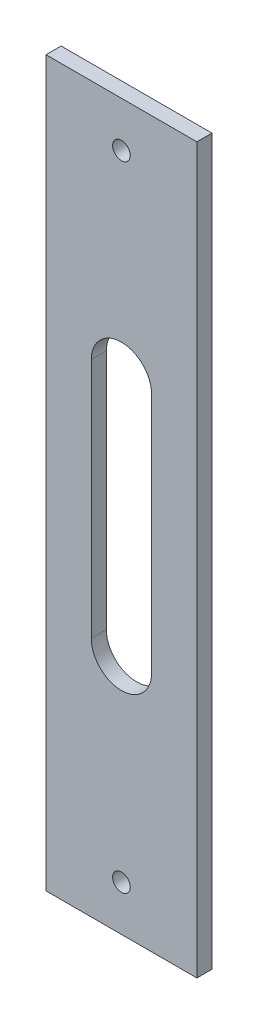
from build123d import *

# Parameters (mm, degrees)
SKETCH1_W          = 15.875
SKETCH1_H          = 76.2
EXTRUDE1_DEPTH     = 1.5875
CUT_EXTRUDE1_DEPTH = 39.950405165
SKETCH3_R          = 0.9271
CUT_EXTRUDE2_DEPTH = 39.950405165


with BuildPart() as part:
    # Sketch1 → Extrude1 (new body)
    with BuildSketch(Plane.XY):
        Rectangle(SKETCH1_W, SKETCH1_H)
    extrude(amount=EXTRUDE1_DEPTH)

    # Sketch2 → Cut-Extrude1 (cut, through all)
    with BuildSketch(Plane.XY.offset(1.5875)):
        with BuildLine():
            Line((-3.175, -12.7), (-3.175, 12.7))
            ThreePointArc((-3.175, 12.7), (0, 15.875), (3.175, 12.7))
            Line((3.175, 12.7), (3.175, -12.7))
            ThreePointArc((3.175, -12.7), (0, -15.875), (-3.175, -12.7))
        make_face()
    extrude(amount=-CUT_EXTRUDE1_DEPTH, mode=Mode.SUBTRACT)

    # Sketch3 → Cut-Extrude2 (cut, through all)
    with BuildSketch(Plane.XY.offset(1.5875)):
        with Locations((0, 33.3375)):
            Circle(SKETCH3_R)
        with Locations((0, -33.3375)):
            Circle(SKETCH3_R)
    extrude(amount=-CUT_EXTRUDE2_DEPTH, mode=Mode.SUBTRACT)


solid = part.part
